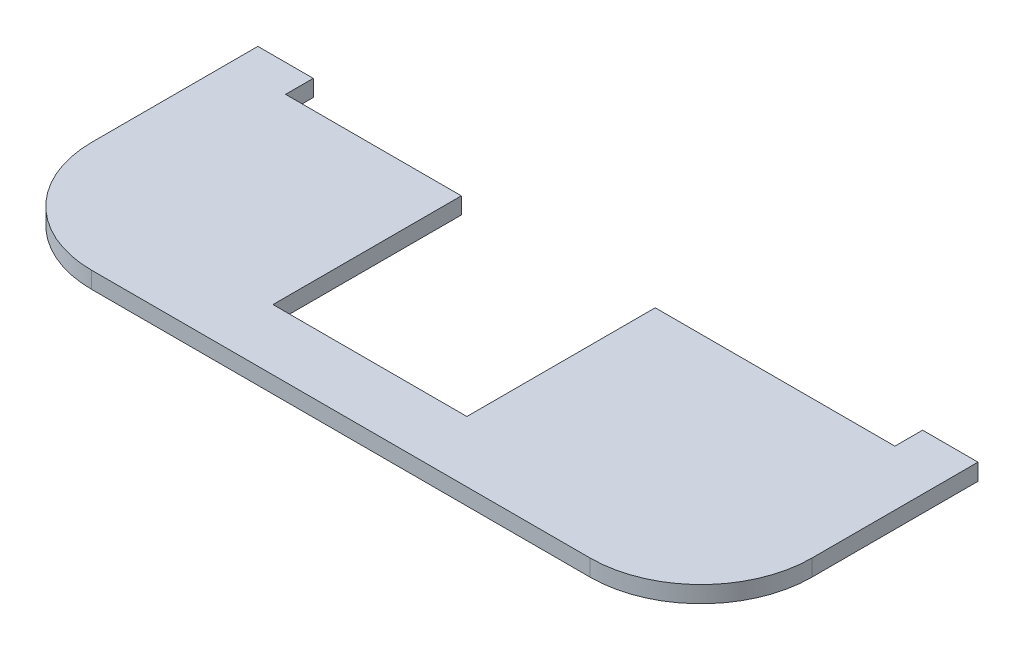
ISO-10303-21;
HEADER;
FILE_DESCRIPTION(('STEP AP214'),'2;1');
FILE_NAME('part.step','',(''),(''),'','','');
FILE_SCHEMA(('AUTOMOTIVE_DESIGN { 1 0 10303 214 1 1 1 1 }'));
ENDSEC;
DATA;
#1=APPLICATION_CONTEXT('core data for automotive mechanical design processes');
#2=APPLICATION_PROTOCOL_DEFINITION('international standard','automotive_design',2000,#1);
#3=PRODUCT_CONTEXT('',#1,'mechanical');
#4=PRODUCT('Part','Part','',(#3));
#5=PRODUCT_RELATED_PRODUCT_CATEGORY('part','',(#4));
#6=PRODUCT_DEFINITION_FORMATION('','',#4);
#7=PRODUCT_DEFINITION_CONTEXT('part definition',#1,'design');
#8=PRODUCT_DEFINITION('design','',#6,#7);
#9=PRODUCT_DEFINITION_SHAPE('','',#8);
#10=(LENGTH_UNIT() NAMED_UNIT(*) SI_UNIT(.MILLI.,.METRE.));
#11=(NAMED_UNIT(*) PLANE_ANGLE_UNIT() SI_UNIT($,.RADIAN.));
#12=(NAMED_UNIT(*) SI_UNIT($,.STERADIAN.) SOLID_ANGLE_UNIT());
#13=UNCERTAINTY_MEASURE_WITH_UNIT(LENGTH_MEASURE(1.E-05),#10,'distance_accuracy_value','');
#14=(GEOMETRIC_REPRESENTATION_CONTEXT(3) GLOBAL_UNCERTAINTY_ASSIGNED_CONTEXT((#13)) GLOBAL_UNIT_ASSIGNED_CONTEXT((#10,
#11,#12)) REPRESENTATION_CONTEXT('',''));
#15=CARTESIAN_POINT('',(0.,0.,0.));
#16=DIRECTION('',(0.,0.,1.));
#17=DIRECTION('',(1.,0.,0.));
#18=AXIS2_PLACEMENT_3D('',#15,#16,#17);
#19=CARTESIAN_POINT('',(0.,3.,-20.0000000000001));
#20=DIRECTION('',(1.,0.,0.));
#21=DIRECTION('',(0.,0.,-1.));
#22=AXIS2_PLACEMENT_3D('',#19,#20,#21);
#23=PLANE('',#22);
#24=DIRECTION('',(0.,1.,0.));
#25=VECTOR('',#24,1.);
#26=CARTESIAN_POINT('',(0.,-7.,-25.));
#27=LINE('',#26,#25);
#28=CARTESIAN_POINT('',(0.,0.,-25.));
#29=VERTEX_POINT('',#28);
#30=CARTESIAN_POINT('',(0.,3.,-25.));
#31=VERTEX_POINT('',#30);
#32=EDGE_CURVE('E164',#29,#31,#27,.T.);
#33=ORIENTED_EDGE('',*,*,#32,.T.);
#34=DIRECTION('',(0.,0.,1.));
#35=VECTOR('',#34,1.);
#36=CARTESIAN_POINT('',(0.,3.,-20.0000000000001));
#37=LINE('',#36,#35);
#38=CARTESIAN_POINT('',(0.,3.,-55.));
#39=VERTEX_POINT('',#38);
#40=EDGE_CURVE('E240',#39,#31,#37,.T.);
#41=ORIENTED_EDGE('',*,*,#40,.F.);
#42=DIRECTION('',(0.,1.,0.));
#43=VECTOR('',#42,1.);
#44=CARTESIAN_POINT('',(0.,-7.,-55.));
#45=LINE('',#44,#43);
#46=CARTESIAN_POINT('',(0.,0.,-55.));
#47=VERTEX_POINT('',#46);
#48=EDGE_CURVE('E169',#47,#39,#45,.T.);
#49=ORIENTED_EDGE('',*,*,#48,.F.);
#50=DIRECTION('',(0.,0.,1.));
#51=VECTOR('',#50,1.);
#52=CARTESIAN_POINT('',(0.,0.,-20.0000000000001));
#53=LINE('',#52,#51);
#54=EDGE_CURVE('E241',#47,#29,#53,.T.);
#55=ORIENTED_EDGE('',*,*,#54,.T.);
#56=EDGE_LOOP('',(#33,#41,#49,#55));
#57=FACE_BOUND('',#56,.T.);
#58=ADVANCED_FACE('F39',(#57),#23,.F.);
#59=CARTESIAN_POINT('',(130.,3.,-20.0000000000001));
#60=DIRECTION('',(-1.,0.,0.));
#61=DIRECTION('',(0.,0.,1.));
#62=AXIS2_PLACEMENT_3D('',#59,#60,#61);
#63=PLANE('',#62);
#64=DIRECTION('',(0.,0.,-1.));
#65=VECTOR('',#64,1.);
#66=CARTESIAN_POINT('',(130.,3.,-20.0000000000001));
#67=LINE('',#66,#65);
#68=CARTESIAN_POINT('',(130.,3.,-25.));
#69=VERTEX_POINT('',#68);
#70=CARTESIAN_POINT('',(130.,3.,-55.));
#71=VERTEX_POINT('',#70);
#72=EDGE_CURVE('E238',#69,#71,#67,.T.);
#73=ORIENTED_EDGE('',*,*,#72,.F.);
#74=DIRECTION('',(0.,1.,0.));
#75=VECTOR('',#74,1.);
#76=CARTESIAN_POINT('',(130.,-7.,-25.));
#77=LINE('',#76,#75);
#78=CARTESIAN_POINT('',(130.,0.,-25.));
#79=VERTEX_POINT('',#78);
#80=EDGE_CURVE('E153',#79,#69,#77,.T.);
#81=ORIENTED_EDGE('',*,*,#80,.F.);
#82=DIRECTION('',(0.,0.,-1.));
#83=VECTOR('',#82,1.);
#84=CARTESIAN_POINT('',(130.,0.,-20.0000000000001));
#85=LINE('',#84,#83);
#86=CARTESIAN_POINT('',(130.,0.,-55.));
#87=VERTEX_POINT('',#86);
#88=EDGE_CURVE('E237',#79,#87,#85,.T.);
#89=ORIENTED_EDGE('',*,*,#88,.T.);
#90=DIRECTION('',(0.,1.,0.));
#91=VECTOR('',#90,1.);
#92=CARTESIAN_POINT('',(130.,-7.,-55.));
#93=LINE('',#92,#91);
#94=EDGE_CURVE('E170',#87,#71,#93,.T.);
#95=ORIENTED_EDGE('',*,*,#94,.T.);
#96=EDGE_LOOP('',(#73,#81,#89,#95));
#97=FACE_BOUND('',#96,.T.);
#98=ADVANCED_FACE('F41',(#97),#63,.F.);
#99=CARTESIAN_POINT('',(20.,3.,-20.));
#100=DIRECTION('',(0.,-1.,0.));
#101=DIRECTION('',(0.,0.,-1.));
#102=AXIS2_PLACEMENT_3D('',#99,#100,#101);
#103=PLANE('',#102);
#104=DIRECTION('',(-1.,0.,0.));
#105=VECTOR('',#104,1.);
#106=CARTESIAN_POINT('',(20.,3.,-5.00000000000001));
#107=LINE('',#106,#105);
#108=CARTESIAN_POINT('',(110.,3.,-5.00000000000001));
#109=VERTEX_POINT('',#108);
#110=CARTESIAN_POINT('',(20.,3.,-5.00000000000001));
#111=VERTEX_POINT('',#110);
#112=EDGE_CURVE('E141',#109,#111,#107,.T.);
#113=ORIENTED_EDGE('',*,*,#112,.F.);
#114=CARTESIAN_POINT('',(110.,3.,-25.));
#115=DIRECTION('',(0.,-1.,0.));
#116=DIRECTION('',(0.,0.,1.));
#117=AXIS2_PLACEMENT_3D('',#114,#115,#116);
#118=CIRCLE('',#117,20.);
#119=EDGE_CURVE('E150',#69,#109,#118,.T.);
#120=ORIENTED_EDGE('',*,*,#119,.F.);
#121=ORIENTED_EDGE('',*,*,#72,.T.);
#122=DIRECTION('',(1.,0.,0.));
#123=VECTOR('',#122,1.);
#124=CARTESIAN_POINT('',(0.,3.,-55.));
#125=LINE('',#124,#123);
#126=CARTESIAN_POINT('',(120.,3.,-55.));
#127=VERTEX_POINT('',#126);
#128=EDGE_CURVE('E163',#127,#71,#125,.T.);
#129=ORIENTED_EDGE('',*,*,#128,.F.);
#130=DIRECTION('',(0.,0.,1.));
#131=VECTOR('',#130,1.);
#132=CARTESIAN_POINT('',(120.,3.,-20.));
#133=LINE('',#132,#131);
#134=CARTESIAN_POINT('',(120.,3.,-50.));
#135=VERTEX_POINT('',#134);
#136=EDGE_CURVE('E220',#127,#135,#133,.T.);
#137=ORIENTED_EDGE('',*,*,#136,.T.);
#138=DIRECTION('',(-1.,0.,0.));
#139=VECTOR('',#138,1.);
#140=CARTESIAN_POINT('',(20.,3.,-50.));
#141=LINE('',#140,#139);
#142=CARTESIAN_POINT('',(76.7316617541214,3.,-50.));
#143=VERTEX_POINT('',#142);
#144=EDGE_CURVE('E203',#135,#143,#141,.T.);
#145=ORIENTED_EDGE('',*,*,#144,.T.);
#146=DIRECTION('',(0.,0.,1.));
#147=VECTOR('',#146,1.);
#148=CARTESIAN_POINT('',(76.7316617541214,3.,-20.));
#149=LINE('',#148,#147);
#150=CARTESIAN_POINT('',(76.7316617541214,3.,-16.));
#151=VERTEX_POINT('',#150);
#152=EDGE_CURVE('E234',#143,#151,#149,.T.);
#153=ORIENTED_EDGE('',*,*,#152,.T.);
#154=DIRECTION('',(-1.,0.,0.));
#155=VECTOR('',#154,1.);
#156=CARTESIAN_POINT('',(20.,3.,-16.));
#157=LINE('',#156,#155);
#158=CARTESIAN_POINT('',(41.7316617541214,3.,-16.));
#159=VERTEX_POINT('',#158);
#160=EDGE_CURVE('E231',#151,#159,#157,.T.);
#161=ORIENTED_EDGE('',*,*,#160,.T.);
#162=DIRECTION('',(0.,0.,-1.));
#163=VECTOR('',#162,1.);
#164=CARTESIAN_POINT('',(41.7316617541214,3.,-20.));
#165=LINE('',#164,#163);
#166=CARTESIAN_POINT('',(41.7316617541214,3.,-50.));
#167=VERTEX_POINT('',#166);
#168=EDGE_CURVE('E228',#159,#167,#165,.T.);
#169=ORIENTED_EDGE('',*,*,#168,.T.);
#170=DIRECTION('',(-1.,0.,0.));
#171=VECTOR('',#170,1.);
#172=CARTESIAN_POINT('',(20.,3.,-50.));
#173=LINE('',#172,#171);
#174=CARTESIAN_POINT('',(10.,3.,-50.));
#175=VERTEX_POINT('',#174);
#176=EDGE_CURVE('E225',#167,#175,#173,.T.);
#177=ORIENTED_EDGE('',*,*,#176,.T.);
#178=DIRECTION('',(0.,0.,-1.));
#179=VECTOR('',#178,1.);
#180=CARTESIAN_POINT('',(10.,3.,-20.));
#181=LINE('',#180,#179);
#182=CARTESIAN_POINT('',(10.,3.,-55.));
#183=VERTEX_POINT('',#182);
#184=EDGE_CURVE('E222',#175,#183,#181,.T.);
#185=ORIENTED_EDGE('',*,*,#184,.T.);
#186=EDGE_CURVE('E62',#39,#183,#125,.T.);
#187=ORIENTED_EDGE('',*,*,#186,.F.);
#188=ORIENTED_EDGE('',*,*,#40,.T.);
#189=CARTESIAN_POINT('',(20.,3.,-25.));
#190=DIRECTION('',(0.,-1.,0.));
#191=DIRECTION('',(0.,0.,-1.));
#192=AXIS2_PLACEMENT_3D('',#189,#190,#191);
#193=CIRCLE('',#192,20.);
#194=EDGE_CURVE('E147',#111,#31,#193,.T.);
#195=ORIENTED_EDGE('',*,*,#194,.F.);
#196=EDGE_LOOP('',(#113,#120,#121,#129,#137,#145,#153,#161,#169,#177,#185,#187,#188,#195));
#197=FACE_BOUND('',#196,.T.);
#198=ADVANCED_FACE('F157',(#197),#103,.F.);
#199=CARTESIAN_POINT('',(20.,0.,-20.));
#200=DIRECTION('',(0.,-1.,0.));
#201=DIRECTION('',(0.,0.,-1.));
#202=AXIS2_PLACEMENT_3D('',#199,#200,#201);
#203=PLANE('',#202);
#204=CARTESIAN_POINT('',(110.,0.,-25.));
#205=DIRECTION('',(0.,-1.,0.));
#206=DIRECTION('',(0.,0.,-1.));
#207=AXIS2_PLACEMENT_3D('',#204,#205,#206);
#208=CIRCLE('',#207,20.);
#209=CARTESIAN_POINT('',(110.,0.,-5.00000000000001));
#210=VERTEX_POINT('',#209);
#211=EDGE_CURVE('E11',#210,#79,#208,.F.);
#212=ORIENTED_EDGE('',*,*,#211,.F.);
#213=DIRECTION('',(1.,0.,0.));
#214=VECTOR('',#213,1.);
#215=CARTESIAN_POINT('',(20.,0.,-5.00000000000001));
#216=LINE('',#215,#214);
#217=CARTESIAN_POINT('',(20.,0.,-5.00000000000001));
#218=VERTEX_POINT('',#217);
#219=EDGE_CURVE('E144',#218,#210,#216,.T.);
#220=ORIENTED_EDGE('',*,*,#219,.F.);
#221=CARTESIAN_POINT('',(20.,0.,-25.));
#222=DIRECTION('',(0.,-1.,0.));
#223=DIRECTION('',(0.,0.,-1.));
#224=AXIS2_PLACEMENT_3D('',#221,#222,#223);
#225=CIRCLE('',#224,20.);
#226=EDGE_CURVE('E47',#29,#218,#225,.F.);
#227=ORIENTED_EDGE('',*,*,#226,.F.);
#228=ORIENTED_EDGE('',*,*,#54,.F.);
#229=DIRECTION('',(-1.,0.,0.));
#230=VECTOR('',#229,1.);
#231=CARTESIAN_POINT('',(20.,0.,-55.));
#232=LINE('',#231,#230);
#233=CARTESIAN_POINT('',(10.,0.,-55.));
#234=VERTEX_POINT('',#233);
#235=EDGE_CURVE('E177',#234,#47,#232,.T.);
#236=ORIENTED_EDGE('',*,*,#235,.F.);
#237=DIRECTION('',(0.,0.,1.));
#238=VECTOR('',#237,1.);
#239=CARTESIAN_POINT('',(9.99999999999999,0.,-70.));
#240=LINE('',#239,#238);
#241=CARTESIAN_POINT('',(10.,0.,-50.));
#242=VERTEX_POINT('',#241);
#243=EDGE_CURVE('E188',#234,#242,#240,.T.);
#244=ORIENTED_EDGE('',*,*,#243,.T.);
#245=DIRECTION('',(1.,0.,0.));
#246=VECTOR('',#245,1.);
#247=CARTESIAN_POINT('',(10.,0.,-50.));
#248=LINE('',#247,#246);
#249=CARTESIAN_POINT('',(41.7316617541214,0.,-50.));
#250=VERTEX_POINT('',#249);
#251=EDGE_CURVE('E190',#242,#250,#248,.T.);
#252=ORIENTED_EDGE('',*,*,#251,.T.);
#253=DIRECTION('',(0.,0.,1.));
#254=VECTOR('',#253,1.);
#255=CARTESIAN_POINT('',(41.7316617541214,0.,-50.));
#256=LINE('',#255,#254);
#257=CARTESIAN_POINT('',(41.7316617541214,0.,-16.));
#258=VERTEX_POINT('',#257);
#259=EDGE_CURVE('E193',#250,#258,#256,.T.);
#260=ORIENTED_EDGE('',*,*,#259,.T.);
#261=DIRECTION('',(1.,0.,0.));
#262=VECTOR('',#261,1.);
#263=CARTESIAN_POINT('',(41.7316617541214,0.,-16.));
#264=LINE('',#263,#262);
#265=CARTESIAN_POINT('',(76.7316617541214,0.,-16.));
#266=VERTEX_POINT('',#265);
#267=EDGE_CURVE('E196',#258,#266,#264,.T.);
#268=ORIENTED_EDGE('',*,*,#267,.T.);
#269=DIRECTION('',(0.,0.,-1.));
#270=VECTOR('',#269,1.);
#271=CARTESIAN_POINT('',(76.7316617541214,0.,-50.));
#272=LINE('',#271,#270);
#273=CARTESIAN_POINT('',(76.7316617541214,0.,-50.));
#274=VERTEX_POINT('',#273);
#275=EDGE_CURVE('E179',#266,#274,#272,.T.);
#276=ORIENTED_EDGE('',*,*,#275,.T.);
#277=DIRECTION('',(1.,0.,0.));
#278=VECTOR('',#277,1.);
#279=CARTESIAN_POINT('',(76.7316617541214,0.,-50.));
#280=LINE('',#279,#278);
#281=CARTESIAN_POINT('',(120.,0.,-50.));
#282=VERTEX_POINT('',#281);
#283=EDGE_CURVE('E182',#274,#282,#280,.T.);
#284=ORIENTED_EDGE('',*,*,#283,.T.);
#285=DIRECTION('',(0.,0.,-1.));
#286=VECTOR('',#285,1.);
#287=CARTESIAN_POINT('',(120.,0.,-70.));
#288=LINE('',#287,#286);
#289=CARTESIAN_POINT('',(120.,0.,-55.));
#290=VERTEX_POINT('',#289);
#291=EDGE_CURVE('E185',#282,#290,#288,.T.);
#292=ORIENTED_EDGE('',*,*,#291,.T.);
#293=EDGE_CURVE('E173',#87,#290,#232,.T.);
#294=ORIENTED_EDGE('',*,*,#293,.F.);
#295=ORIENTED_EDGE('',*,*,#88,.F.);
#296=EDGE_LOOP('',(#212,#220,#227,#228,#236,#244,#252,#260,#268,#276,#284,#292,#294,#295));
#297=FACE_BOUND('',#296,.T.);
#298=ADVANCED_FACE('F254',(#297),#203,.T.);
#299=CARTESIAN_POINT('',(76.7316617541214,0.,-50.));
#300=DIRECTION('',(1.,0.,0.));
#301=DIRECTION('',(0.,0.,-1.));
#302=AXIS2_PLACEMENT_3D('',#299,#300,#301);
#303=PLANE('',#302);
#304=DIRECTION('',(0.,1.,0.));
#305=VECTOR('',#304,1.);
#306=CARTESIAN_POINT('',(76.7316617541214,0.,-50.));
#307=LINE('',#306,#305);
#308=EDGE_CURVE('E199',#274,#143,#307,.T.);
#309=ORIENTED_EDGE('',*,*,#308,.F.);
#310=ORIENTED_EDGE('',*,*,#275,.F.);
#311=DIRECTION('',(0.,1.,0.));
#312=VECTOR('',#311,1.);
#313=CARTESIAN_POINT('',(76.7316617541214,0.,-16.));
#314=LINE('',#313,#312);
#315=EDGE_CURVE('E200',#266,#151,#314,.T.);
#316=ORIENTED_EDGE('',*,*,#315,.T.);
#317=ORIENTED_EDGE('',*,*,#152,.F.);
#318=EDGE_LOOP('',(#309,#310,#316,#317));
#319=FACE_BOUND('',#318,.T.);
#320=ADVANCED_FACE('F273',(#319),#303,.F.);
#321=CARTESIAN_POINT('',(41.7316617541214,0.,-16.));
#322=DIRECTION('',(0.,0.,1.));
#323=DIRECTION('',(1.,0.,0.));
#324=AXIS2_PLACEMENT_3D('',#321,#322,#323);
#325=PLANE('',#324);
#326=ORIENTED_EDGE('',*,*,#315,.F.);
#327=ORIENTED_EDGE('',*,*,#267,.F.);
#328=DIRECTION('',(0.,1.,0.));
#329=VECTOR('',#328,1.);
#330=CARTESIAN_POINT('',(41.7316617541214,0.,-16.));
#331=LINE('',#330,#329);
#332=EDGE_CURVE('E204',#258,#159,#331,.T.);
#333=ORIENTED_EDGE('',*,*,#332,.T.);
#334=ORIENTED_EDGE('',*,*,#160,.F.);
#335=EDGE_LOOP('',(#326,#327,#333,#334));
#336=FACE_BOUND('',#335,.T.);
#337=ADVANCED_FACE('F276',(#336),#325,.F.);
#338=CARTESIAN_POINT('',(41.7316617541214,0.,-50.));
#339=DIRECTION('',(-1.,0.,0.));
#340=DIRECTION('',(0.,0.,1.));
#341=AXIS2_PLACEMENT_3D('',#338,#339,#340);
#342=PLANE('',#341);
#343=ORIENTED_EDGE('',*,*,#332,.F.);
#344=ORIENTED_EDGE('',*,*,#259,.F.);
#345=DIRECTION('',(0.,1.,0.));
#346=VECTOR('',#345,1.);
#347=CARTESIAN_POINT('',(41.7316617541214,0.,-50.));
#348=LINE('',#347,#346);
#349=EDGE_CURVE('E207',#250,#167,#348,.T.);
#350=ORIENTED_EDGE('',*,*,#349,.T.);
#351=ORIENTED_EDGE('',*,*,#168,.F.);
#352=EDGE_LOOP('',(#343,#344,#350,#351));
#353=FACE_BOUND('',#352,.T.);
#354=ADVANCED_FACE('F279',(#353),#342,.F.);
#355=CARTESIAN_POINT('',(10.,0.,-50.));
#356=DIRECTION('',(0.,0.,1.));
#357=DIRECTION('',(1.,0.,0.));
#358=AXIS2_PLACEMENT_3D('',#355,#356,#357);
#359=PLANE('',#358);
#360=ORIENTED_EDGE('',*,*,#349,.F.);
#361=ORIENTED_EDGE('',*,*,#251,.F.);
#362=DIRECTION('',(0.,1.,0.));
#363=VECTOR('',#362,1.);
#364=CARTESIAN_POINT('',(10.,0.,-50.));
#365=LINE('',#364,#363);
#366=EDGE_CURVE('E210',#242,#175,#365,.T.);
#367=ORIENTED_EDGE('',*,*,#366,.T.);
#368=ORIENTED_EDGE('',*,*,#176,.F.);
#369=EDGE_LOOP('',(#360,#361,#367,#368));
#370=FACE_BOUND('',#369,.T.);
#371=ADVANCED_FACE('F281',(#370),#359,.F.);
#372=CARTESIAN_POINT('',(10.,0.,-53.));
#373=DIRECTION('',(-1.,0.,0.));
#374=DIRECTION('',(0.,0.,1.));
#375=AXIS2_PLACEMENT_3D('',#372,#373,#374);
#376=PLANE('',#375);
#377=ORIENTED_EDGE('',*,*,#243,.F.);
#378=DIRECTION('',(0.,1.,0.));
#379=VECTOR('',#378,1.);
#380=CARTESIAN_POINT('',(10.,0.,-55.));
#381=LINE('',#380,#379);
#382=EDGE_CURVE('E176',#234,#183,#381,.T.);
#383=ORIENTED_EDGE('',*,*,#382,.T.);
#384=ORIENTED_EDGE('',*,*,#184,.F.);
#385=ORIENTED_EDGE('',*,*,#366,.F.);
#386=EDGE_LOOP('',(#377,#383,#384,#385));
#387=FACE_BOUND('',#386,.T.);
#388=ADVANCED_FACE('F286',(#387),#376,.F.);
#389=CARTESIAN_POINT('',(120.,0.,-70.));
#390=DIRECTION('',(1.,0.,0.));
#391=DIRECTION('',(0.,0.,-1.));
#392=AXIS2_PLACEMENT_3D('',#389,#390,#391);
#393=PLANE('',#392);
#394=ORIENTED_EDGE('',*,*,#136,.F.);
#395=DIRECTION('',(0.,-1.,0.));
#396=VECTOR('',#395,1.);
#397=CARTESIAN_POINT('',(120.,0.,-55.));
#398=LINE('',#397,#396);
#399=EDGE_CURVE('E243',#127,#290,#398,.T.);
#400=ORIENTED_EDGE('',*,*,#399,.T.);
#401=ORIENTED_EDGE('',*,*,#291,.F.);
#402=DIRECTION('',(0.,1.,0.));
#403=VECTOR('',#402,1.);
#404=CARTESIAN_POINT('',(120.,0.,-50.));
#405=LINE('',#404,#403);
#406=EDGE_CURVE('E213',#282,#135,#405,.T.);
#407=ORIENTED_EDGE('',*,*,#406,.T.);
#408=EDGE_LOOP('',(#394,#400,#401,#407));
#409=FACE_BOUND('',#408,.T.);
#410=ADVANCED_FACE('F265',(#409),#393,.F.);
#411=CARTESIAN_POINT('',(76.7316617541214,0.,-50.));
#412=DIRECTION('',(0.,0.,1.));
#413=DIRECTION('',(1.,0.,0.));
#414=AXIS2_PLACEMENT_3D('',#411,#412,#413);
#415=PLANE('',#414);
#416=ORIENTED_EDGE('',*,*,#406,.F.);
#417=ORIENTED_EDGE('',*,*,#283,.F.);
#418=ORIENTED_EDGE('',*,*,#308,.T.);
#419=ORIENTED_EDGE('',*,*,#144,.F.);
#420=EDGE_LOOP('',(#416,#417,#418,#419));
#421=FACE_BOUND('',#420,.T.);
#422=ADVANCED_FACE('F270',(#421),#415,.F.);
#423=CARTESIAN_POINT('',(0.,-7.,-55.));
#424=DIRECTION('',(0.,0.,1.));
#425=DIRECTION('',(1.,0.,0.));
#426=AXIS2_PLACEMENT_3D('',#423,#424,#425);
#427=PLANE('',#426);
#428=ORIENTED_EDGE('',*,*,#293,.T.);
#429=ORIENTED_EDGE('',*,*,#399,.F.);
#430=ORIENTED_EDGE('',*,*,#128,.T.);
#431=ORIENTED_EDGE('',*,*,#94,.F.);
#432=EDGE_LOOP('',(#428,#429,#430,#431));
#433=FACE_BOUND('',#432,.T.);
#434=ADVANCED_FACE('F263',(#433),#427,.F.);
#435=ORIENTED_EDGE('',*,*,#235,.T.);
#436=ORIENTED_EDGE('',*,*,#48,.T.);
#437=ORIENTED_EDGE('',*,*,#186,.T.);
#438=ORIENTED_EDGE('',*,*,#382,.F.);
#439=EDGE_LOOP('',(#435,#436,#437,#438));
#440=FACE_BOUND('',#439,.T.);
#441=ADVANCED_FACE('F288',(#440),#427,.F.);
#442=CARTESIAN_POINT('',(110.,-7.,-25.));
#443=DIRECTION('',(0.,1.,0.));
#444=DIRECTION('',(0.,0.,1.));
#445=AXIS2_PLACEMENT_3D('',#442,#443,#444);
#446=CYLINDRICAL_SURFACE('',#445,20.);
#447=ORIENTED_EDGE('',*,*,#211,.T.);
#448=ORIENTED_EDGE('',*,*,#80,.T.);
#449=ORIENTED_EDGE('',*,*,#119,.T.);
#450=DIRECTION('',(0.,1.,0.));
#451=VECTOR('',#450,1.);
#452=CARTESIAN_POINT('',(110.,-7.,-5.00000000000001));
#453=LINE('',#452,#451);
#454=EDGE_CURVE('E137',#210,#109,#453,.T.);
#455=ORIENTED_EDGE('',*,*,#454,.F.);
#456=EDGE_LOOP('',(#447,#448,#449,#455));
#457=FACE_BOUND('',#456,.T.);
#458=ADVANCED_FACE('F151',(#457),#446,.T.);
#459=CARTESIAN_POINT('',(20.,-7.,-25.));
#460=DIRECTION('',(0.,1.,0.));
#461=DIRECTION('',(0.,0.,1.));
#462=AXIS2_PLACEMENT_3D('',#459,#460,#461);
#463=CYLINDRICAL_SURFACE('',#462,20.);
#464=ORIENTED_EDGE('',*,*,#226,.T.);
#465=DIRECTION('',(0.,1.,0.));
#466=VECTOR('',#465,1.);
#467=CARTESIAN_POINT('',(20.,-7.,-5.00000000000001));
#468=LINE('',#467,#466);
#469=EDGE_CURVE('E54',#218,#111,#468,.T.);
#470=ORIENTED_EDGE('',*,*,#469,.T.);
#471=ORIENTED_EDGE('',*,*,#194,.T.);
#472=ORIENTED_EDGE('',*,*,#32,.F.);
#473=EDGE_LOOP('',(#464,#470,#471,#472));
#474=FACE_BOUND('',#473,.T.);
#475=ADVANCED_FACE('F251',(#474),#463,.T.);
#476=CARTESIAN_POINT('',(20.,-7.,-5.00000000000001));
#477=DIRECTION('',(0.,0.,-1.));
#478=DIRECTION('',(-1.,0.,0.));
#479=AXIS2_PLACEMENT_3D('',#476,#477,#478);
#480=PLANE('',#479);
#481=ORIENTED_EDGE('',*,*,#219,.T.);
#482=ORIENTED_EDGE('',*,*,#454,.T.);
#483=ORIENTED_EDGE('',*,*,#112,.T.);
#484=ORIENTED_EDGE('',*,*,#469,.F.);
#485=EDGE_LOOP('',(#481,#482,#483,#484));
#486=FACE_BOUND('',#485,.T.);
#487=ADVANCED_FACE('F139',(#486),#480,.F.);
#488=CLOSED_SHELL('',(#58,#98,#198,#298,#320,#337,#354,#371,#388,#410,#422,#434,#441,#458,#475,#487));
#489=MANIFOLD_SOLID_BREP('B2',#488);
#490=ADVANCED_BREP_SHAPE_REPRESENTATION('',(#18,#489),#14);
#491=SHAPE_DEFINITION_REPRESENTATION(#9,#490);
ENDSEC;
END-ISO-10303-21;
